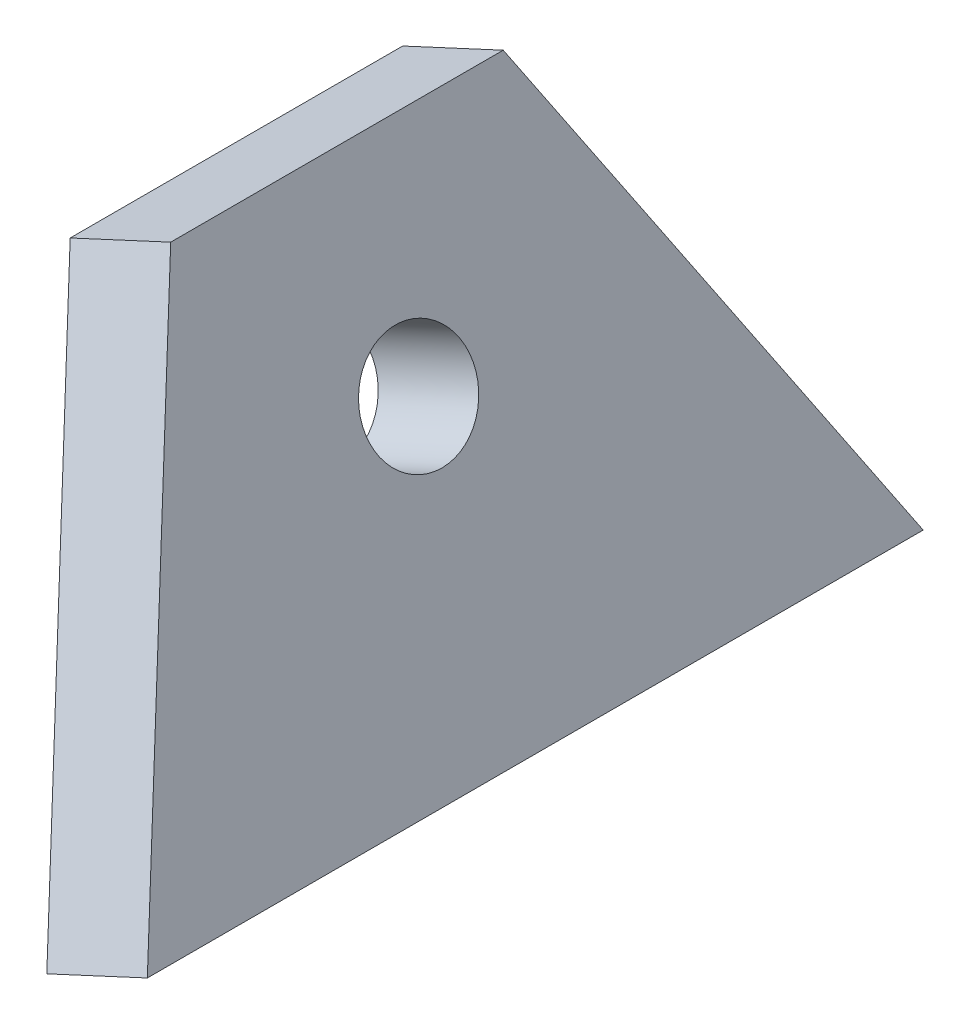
from build123d import *

# Parameters (mm, degrees)
YUGO_DEPTH          = 4
OJO_CABLE_PROFILE_R = 2


with BuildPart() as part:
    # Sk_Yugo → Yugo (new body)
    with BuildSketch(Plane(origin=(520.131353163, 241.389918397, 0), x_dir=(0, 0, 1), z_dir=(-0.9070753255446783, -0.42096835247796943, 0))):
        Polygon((-14, 229.585521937), (14, 229.585521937), (6, 246.585521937), (-6, 246.585521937), align=None)
    extrude(amount=-YUGO_DEPTH)

    # Ojo_cable: sweep along a curve in space
    with BuildLine() as ojo_cable_path:
        Line((418.36635539, 458.291065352, 0), (423.808807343, 460.816875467, 0))
    # Ojo_cable profile (on start of the path) → Ojo_cable (sweep, cut)
    with BuildSketch(Plane(origin=(418.36635539, 458.291065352, 0), x_dir=(-0.420968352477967, 0.9070753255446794, 0), z_dir=(0.9070753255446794, 0.420968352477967, 0))):
        Circle(OJO_CABLE_PROFILE_R)
    sweep(path=ojo_cable_path.line, mode=Mode.SUBTRACT)


solid = part.part
